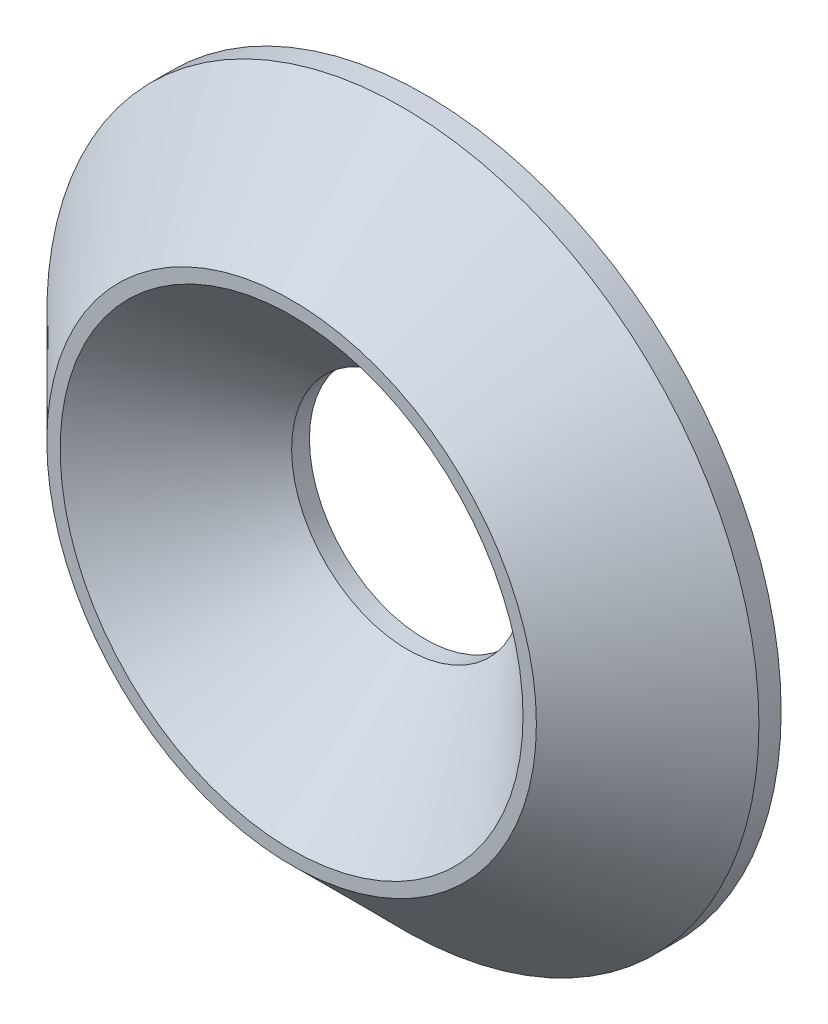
from build123d import *

# Parameters (mm, degrees)
ESQUISSE1_R          = 8
ESQUISSE1_R_2        = 2.6
BASE_EXTRUSION_DEPTH = 3
CHANFREIN2_SIZE      = 2.5
CHANFREIN3_SIZE      = 2.6


with BuildPart() as part:
    # Esquisse1 → Base-Extrusion (new body)
    with BuildSketch(Plane.XY):
        Circle(ESQUISSE1_R)
        Circle(ESQUISSE1_R_2, mode=Mode.SUBTRACT)
    extrude(amount=BASE_EXTRUSION_DEPTH)

    # Chanfrein2
    chanfrein2_edges = [part.edges().sort_by_distance(p)[0] for p in [
        (-8, 0, 3),
    ]]
    chamfer(chanfrein2_edges, length=CHANFREIN2_SIZE)

    # Chanfrein3
    chanfrein3_edges = [part.edges().sort_by_distance(p)[0] for p in [
        (-2.6, 0, 3),
    ]]
    chamfer(chanfrein3_edges, length=CHANFREIN3_SIZE)


solid = part.part
